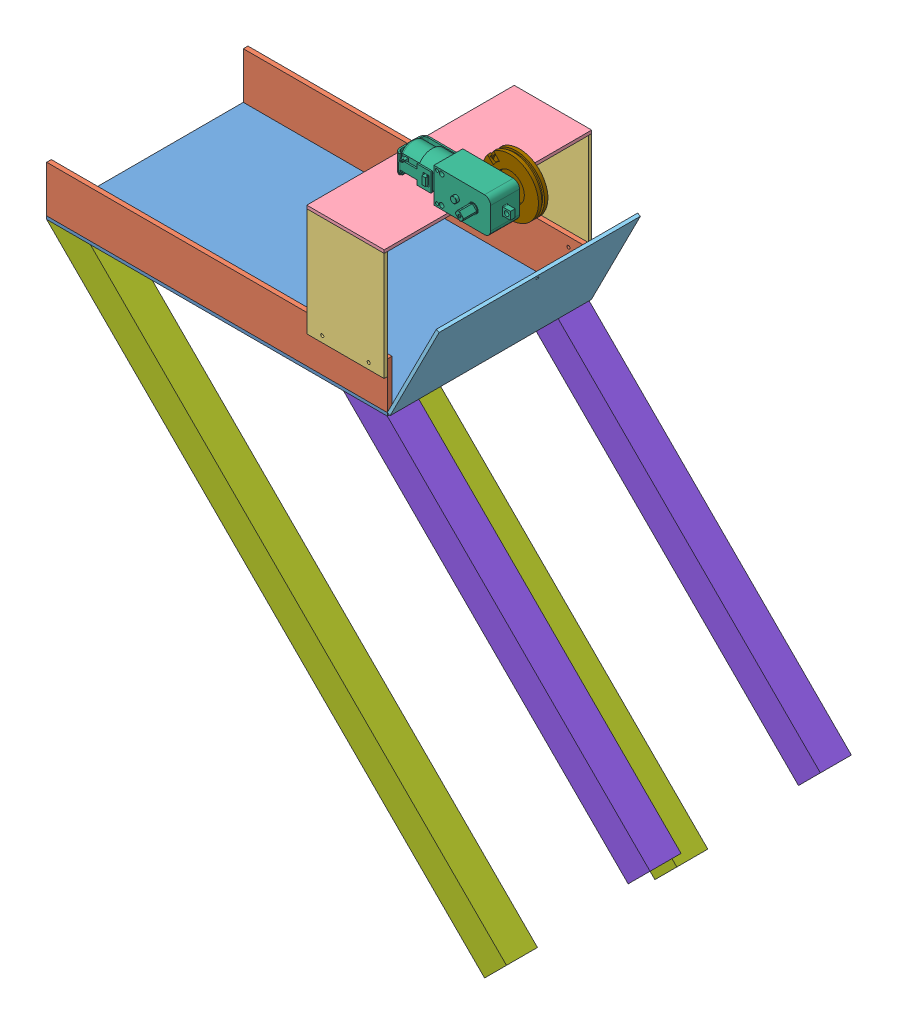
SolidWorks assembly assembly_dispenser_1_can.SLDASM, configuration Default (file format 13000). Lengths in mm.
Overall size (389.71 414.94 134).
13 component instances, 9 part files, 36 mates.
Components (placement in the parent):
- bottom-1: bottom.SLDPRT [Default] at (70.9526 113.3874 175.7269) size (220 2 130)
- sides-2: sides.SLDPRT [Default] at (70.9526 130.3874 110.7269) x (1 0 0) z (0 -1 0) size (220 3 30)
- sides-3: sides.SLDPRT [Default] at (70.9526 130.3874 237.7269) x (1 0 0) z (0 -1 0) size (220 3 30)
- side_motor_hold-1: side_motor_hold.SLDPRT [Default] at (155.9526 170.3874 242.7269) x (0 1 0) z (-1 0 0) size (70 2 50)
- side_motor_hold-3: side_motor_hold.SLDPRT [Default] at (155.9526 170.3874 108.7269) x (0 1 0) z (1 0 0) size (70 2 50)
- top_motor_hold-1: top_motor_hold.SLDPRT [Default] at (155.9526 205.3874 175.7269) x (0 0 1) z (-1 0 0) size (134 2 50)
- door-1: door.SLDPRT [Default] at (198.5786 145.6913 175.7303) x (0 0 -1) z (0.452647 0.89169 0) size (130 2 70)
- Hobby_GearMotor-1: Hobby_GearMotor.SLDPRT [Default] at (190.487 218.5474 192.5103) x (0 -1 0) z (-0.005295 0 0.999986) size (22.32 69.38 36.57)
- leg_tall-2: leg_tall.SLDPRT [Default] at (109.445 -20.9629 240.7269) x (0.707107 -0.707107 0) z (0.707107 0.707107 0) size (400 20 20)
- leg_tall-3: leg_tall.SLDPRT [Default] at (109.445 -20.9629 130.7269) x (0.707107 -0.707107 0) z (0.707107 0.707107 0) size (400 20 20)
- leg_small-1: leg_small.SLDPRT [Default] at (258.7343 21.4636 240.7269) x (0.707107 -0.707107 0) z (0.707107 0.707107 0) size (260 20 20)
- leg_small-2: leg_small.SLDPRT [Default] at (258.7343 21.4636 130.7269) x (0.707107 -0.707107 0) z (0.707107 0.707107 0) size (260 20 20)
- Pulley-1: Pulley.SLDPRT [Default] at (197.7295 218.5474 175.0514) x (0.707097 -0.707107 0.003744) z (-0.005295 0 0.999986) size (38.1 38.1 6.1)
Mates (geometry in assembly coordinates):
- Coincident2: coincident anti-aligned: line of bottom-1 through (-39.0474 115.3874 240.7269) axis (1 0 0); line of sides-1 through (180.9526 115.3874 240.7269) axis (-1 0 0)
- Coincident3: coincident anti-aligned: plane of bottom-1 through (70.9526 115.3874 175.7269) normal (0 1 0); plane of sides-1 through (-39.0474 115.3874 237.7269) normal (0 -1 0)
- Coincident4: coincident anti-aligned: line of bottom-1 through (180.9526 115.3874 240.7269) axis (0 0 -1); line of sides-1 through (180.9526 115.3874 237.7269) axis (0 0 1)
- Coincident5: coincident anti-aligned: line of bottom-1 through (180.9526 115.3874 110.7269) axis (-1 0 0); line of sides-2 through (-39.0474 115.3874 110.7269) axis (1 0 0)
- Coincident6: coincident anti-aligned: plane of bottom-1 through (70.9526 115.3874 175.7269) normal (0 1 0); plane of sides-2 through (-39.0474 115.3874 113.7269) normal (0 -1 0)
- Coincident7: coincident aligned: plane of bottom-1 through (180.9526 115.3874 110.7269) normal (1 0 0); plane of sides-2 through (180.9526 145.3874 113.7269) normal (1 0 0)
- Coincident9: coincident aligned: line of bottom-1 through (-39.0474 115.3874 240.7269) axis (1 0 0); line of sides-3 through (-39.0474 115.3874 240.7269) axis (1 0 0)
- Coincident10: coincident anti-aligned: plane of bottom-1 through (70.9526 115.3874 175.7269) normal (0 1 0); plane of sides-3 through (-39.0474 115.3874 240.7269) normal (0 -1 0)
- Coincident11: coincident aligned: line of bottom-1 through (180.9526 115.3874 240.7269) axis (0 0 -1); line of sides-3 through (180.9526 115.3874 240.7269) axis (0 0 -1)
- Coincident12: coincident anti-aligned: circle of sides-3; circle of side_motor_hold-1
- Coincident13: coincident anti-aligned: circle of sides-3; circle of side_motor_hold-1
- Coincident22: coincident aligned: circle of sides-2; circle of side_motor_hold-3
- Coincident23: coincident aligned: circle of sides-2; circle of side_motor_hold-3
- Coincident26: coincident aligned: line of side_motor_hold-1 through (130.9526 205.3874 242.7269) axis (1 0 0); line of top_motor_hold-1 through (130.9526 205.3874 242.7269) axis (1 0 0)
- Coincident27: coincident aligned: line of side_motor_hold-3 through (180.9526 205.3874 108.7269) axis (-1 0 0); line of top_motor_hold-1 through (180.9526 205.3874 108.7269) axis (-1 0 0)
- Coincident28: coincident anti-aligned: line of side_motor_hold-3 through (130.9526 205.3874 110.7269) axis (0 0 -1); line of top_motor_hold-1 through (130.9526 205.3874 108.7269) axis (0 0 1)
- Coincident29: coincident anti-aligned: line of bottom-1 through (180.9526 115.3874 240.7269) axis (0 0 -1); line of door-1 through (180.9526 115.3874 110.7303) axis (0 0 1)
- Coincident31: coincident anti-aligned: plane of top_motor_hold-1 through (155.9526 207.3874 175.7269) normal (0 1 0); plane of Hobby_GearMotor-1 through (172.0382 207.3874 201.6827) normal (0 -1 0)
- Coincident32: coincident: plane of bottom-1 through (70.9526 113.3874 175.7269) normal (0 -1 0); plane of leg_tall-1 through (-39.0474 113.3874 220.7269) normal (0 1 0)
- Coincident33: coincident: line of bottom-1 through (-39.0474 113.3874 110.7269) axis (0 0 1); line of leg_tall-1 through (-39.0474 113.3874 220.7269) axis (0 0 1)
- Coincident34: coincident: line of bottom-1 through (-39.0474 113.3874 240.7269) axis (1 0 0); line of leg_tall-1 through (-39.0474 113.3874 240.7269) axis (1 0 0)
- Coincident36: coincident: plane of assembly through (0 0 0) normal (0 1 0); plane of leg_tall-1 through (243.7953 -169.4553 220.7269) normal (0.707107 -0.707107 0); plane of assembly
- Coincident44: coincident anti-aligned: plane of bottom-1 through (70.9526 113.3874 175.7269) normal (0 -1 0); plane of leg_tall-2 through (-39.0474 113.3874 220.7269) normal (0 1 0)
- Coincident45: coincident aligned: line of bottom-1 through (-39.0474 113.3874 240.7269) axis (1 0 0); line of leg_tall-2 through (-39.0474 113.3874 240.7269) axis (1 0 0)
- Coincident46: coincident aligned: line of bottom-1 through (-39.0474 113.3874 110.7269) axis (0 0 1); line of leg_tall-2 through (-39.0474 113.3874 220.7269) axis (0 0 1)
- Coincident47: coincident anti-aligned: plane of bottom-1 through (70.9526 113.3874 175.7269) normal (0 -1 0); plane of leg_tall-3 through (-39.0474 113.3874 110.7269) normal (0 1 0)
- Coincident48: coincident aligned: line of bottom-1 through (-39.0474 113.3874 110.7269) axis (0 0 1); line of leg_tall-3 through (-39.0474 113.3874 110.7269) axis (0 0 1)
- Coincident49: coincident anti-aligned: line of bottom-1 through (180.9526 113.3874 110.7269) axis (-1 0 0); line of leg_tall-3 through (-39.0474 113.3874 110.7269) axis (1 0 0)
- Coincident50: coincident anti-aligned: plane of bottom-1 through (70.9526 113.3874 175.7269) normal (0 -1 0); plane of leg_small-1 through (180.9526 113.3874 220.7269) normal (0 1 0)
- Coincident51: coincident aligned: line of bottom-1 through (-39.0474 113.3874 240.7269) axis (1 0 0); line of leg_small-1 through (152.6683 113.3874 240.7269) axis (1 0 0)
- Coincident52: coincident anti-aligned: line of bottom-1 through (180.9526 113.3874 240.7269) axis (0 0 -1); line of leg_small-1 through (180.9526 113.3874 220.7269) axis (0 0 1)
- Coincident53: coincident anti-aligned: plane of bottom-1 through (70.9526 113.3874 175.7269) normal (0 -1 0); plane of leg_small-2 through (180.9526 113.3874 110.7269) normal (0 1 0)
- Coincident54: coincident anti-aligned: line of bottom-1 through (180.9526 113.3874 110.7269) axis (-1 0 0); line of leg_small-2 through (152.6683 113.3874 110.7269) axis (1 0 0)
- Coincident55: coincident anti-aligned: line of bottom-1 through (180.9526 113.3874 240.7269) axis (0 0 -1); line of leg_small-2 through (180.9526 113.3874 110.7269) axis (0 0 1)
- Concentric3: concentric aligned: cylinder of Hobby_GearMotor-1 through (197.7336 218.5474 174.2784) axis (-0.005295 0 0.999986) radius 2.7; cylinder of Pulley-1 through (197.7404 218.5474 173.0044) axis (-0.005295 0 0.999986) radius 2.7
- Coincident58: coincident aligned: circle of Hobby_GearMotor-1; circle of Pulley-1
